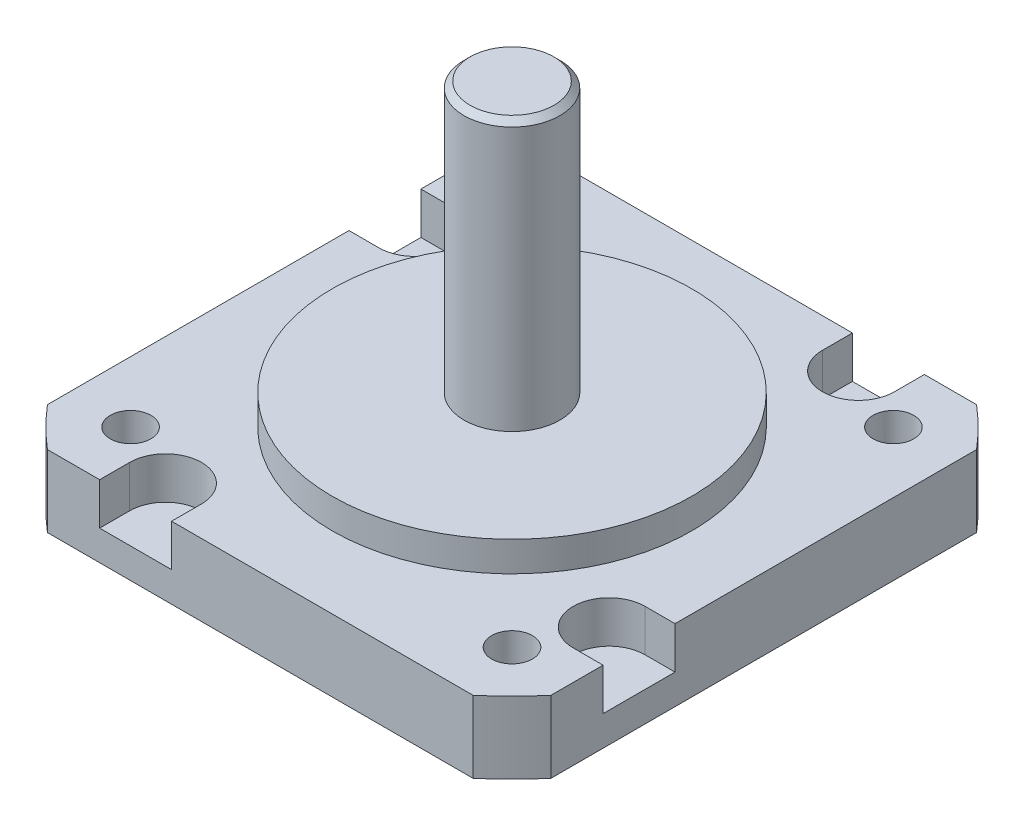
ISO-10303-21;
HEADER;
FILE_DESCRIPTION(('STEP AP214'),'2;1');
FILE_NAME('part.step','',(''),(''),'','','');
FILE_SCHEMA(('AUTOMOTIVE_DESIGN { 1 0 10303 214 1 1 1 1 }'));
ENDSEC;
DATA;
#1=APPLICATION_CONTEXT('core data for automotive mechanical design processes');
#2=APPLICATION_PROTOCOL_DEFINITION('international standard','automotive_design',2000,#1);
#3=PRODUCT_CONTEXT('',#1,'mechanical');
#4=PRODUCT('Part','Part','',(#3));
#5=PRODUCT_RELATED_PRODUCT_CATEGORY('part','',(#4));
#6=PRODUCT_DEFINITION_FORMATION('','',#4);
#7=PRODUCT_DEFINITION_CONTEXT('part definition',#1,'design');
#8=PRODUCT_DEFINITION('design','',#6,#7);
#9=PRODUCT_DEFINITION_SHAPE('','',#8);
#10=(LENGTH_UNIT() NAMED_UNIT(*) SI_UNIT(.MILLI.,.METRE.));
#11=(NAMED_UNIT(*) PLANE_ANGLE_UNIT() SI_UNIT($,.RADIAN.));
#12=(NAMED_UNIT(*) SI_UNIT($,.STERADIAN.) SOLID_ANGLE_UNIT());
#13=UNCERTAINTY_MEASURE_WITH_UNIT(LENGTH_MEASURE(1.E-05),#10,'distance_accuracy_value','');
#14=(GEOMETRIC_REPRESENTATION_CONTEXT(3) GLOBAL_UNCERTAINTY_ASSIGNED_CONTEXT((#13)) GLOBAL_UNIT_ASSIGNED_CONTEXT((#10,
#11,#12)) REPRESENTATION_CONTEXT('',''));
#15=CARTESIAN_POINT('',(0.,0.,0.));
#16=DIRECTION('',(0.,0.,1.));
#17=DIRECTION('',(1.,0.,0.));
#18=AXIS2_PLACEMENT_3D('',#15,#16,#17);
#19=CARTESIAN_POINT('',(0.,13.5,0.));
#20=DIRECTION('',(0.,1.,0.));
#21=DIRECTION('',(0.,0.,1.));
#22=AXIS2_PLACEMENT_3D('',#19,#20,#21);
#23=CYLINDRICAL_SURFACE('',#22,15.);
#24=CARTESIAN_POINT('',(0.,13.5,0.));
#25=DIRECTION('',(0.,1.,0.));
#26=DIRECTION('',(0.,0.,1.));
#27=AXIS2_PLACEMENT_3D('',#24,#25,#26);
#28=CIRCLE('',#27,15.);
#29=CARTESIAN_POINT('',(0.,13.5,15.));
#30=VERTEX_POINT('',#29);
#31=EDGE_CURVE('E11',#30,#30,#28,.T.);
#32=ORIENTED_EDGE('',*,*,#31,.T.);
#33=EDGE_LOOP('',(#32));
#34=FACE_BOUND('',#33,.T.);
#35=CARTESIAN_POINT('',(0.,16.,0.));
#36=DIRECTION('',(0.,1.,0.));
#37=DIRECTION('',(0.,0.,1.));
#38=AXIS2_PLACEMENT_3D('',#35,#36,#37);
#39=CIRCLE('',#38,15.);
#40=CARTESIAN_POINT('',(0.,16.,15.));
#41=VERTEX_POINT('',#40);
#42=EDGE_CURVE('E51',#41,#41,#39,.T.);
#43=ORIENTED_EDGE('',*,*,#42,.F.);
#44=EDGE_LOOP('',(#43));
#45=FACE_BOUND('',#44,.T.);
#46=ADVANCED_FACE('F45',(#34,#45),#23,.T.);
#47=CARTESIAN_POINT('',(15.,13.5,0.));
#48=DIRECTION('',(0.,-1.,0.));
#49=DIRECTION('',(0.,0.,-1.));
#50=AXIS2_PLACEMENT_3D('',#47,#48,#49);
#51=PLANE('',#50);
#52=ORIENTED_EDGE('',*,*,#31,.F.);
#53=EDGE_LOOP('',(#52));
#54=FACE_BOUND('',#53,.T.);
#55=ADVANCED_FACE('F60',(#54),#51,.T.);
#56=CARTESIAN_POINT('',(0.,16.,0.));
#57=DIRECTION('',(0.,1.,0.));
#58=DIRECTION('',(0.,0.,1.));
#59=AXIS2_PLACEMENT_3D('',#56,#57,#58);
#60=PLANE('',#59);
#61=ORIENTED_EDGE('',*,*,#42,.T.);
#62=EDGE_LOOP('',(#61));
#63=FACE_BOUND('',#62,.T.);
#64=ADVANCED_FACE('F57',(#63),#60,.T.);
#65=CLOSED_SHELL('',(#46,#55,#64));
#66=MANIFOLD_SOLID_BREP('B2',#65);
#67=CARTESIAN_POINT('',(0.,7.50000000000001,0.));
#68=DIRECTION('',(0.,1.,0.));
#69=DIRECTION('',(0.,0.,1.));
#70=AXIS2_PLACEMENT_3D('',#67,#68,#69);
#71=CYLINDRICAL_SURFACE('',#70,27.5);
#72=CARTESIAN_POINT('',(0.,13.5,0.));
#73=DIRECTION('',(0.,1.,0.));
#74=DIRECTION('',(0.,0.,1.));
#75=AXIS2_PLACEMENT_3D('',#72,#73,#74);
#76=CIRCLE('',#75,27.5);
#77=CARTESIAN_POINT('',(17.7549999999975,13.5,21.0002374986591));
#78=VERTEX_POINT('',#77);
#79=CARTESIAN_POINT('',(21.000237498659,13.5,17.7549999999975));
#80=VERTEX_POINT('',#79);
#81=EDGE_CURVE('E375',#78,#80,#76,.T.);
#82=ORIENTED_EDGE('',*,*,#81,.F.);
#83=DIRECTION('',(0.,1.,0.));
#84=VECTOR('',#83,1.);
#85=CARTESIAN_POINT('',(17.7549999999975,7.50000000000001,21.0002374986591));
#86=LINE('',#85,#84);
#87=CARTESIAN_POINT('',(17.7549999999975,7.50000000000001,21.0002374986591));
#88=VERTEX_POINT('',#87);
#89=EDGE_CURVE('E43',#88,#78,#86,.T.);
#90=ORIENTED_EDGE('',*,*,#89,.F.);
#91=CARTESIAN_POINT('',(0.,7.50000000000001,0.));
#92=DIRECTION('',(0.,1.,0.));
#93=DIRECTION('',(0.,0.,1.));
#94=AXIS2_PLACEMENT_3D('',#91,#92,#93);
#95=CIRCLE('',#94,27.5);
#96=CARTESIAN_POINT('',(21.000237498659,7.50000000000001,17.7549999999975));
#97=VERTEX_POINT('',#96);
#98=EDGE_CURVE('E383',#88,#97,#95,.T.);
#99=ORIENTED_EDGE('',*,*,#98,.T.);
#100=DIRECTION('',(0.,1.,0.));
#101=VECTOR('',#100,1.);
#102=CARTESIAN_POINT('',(21.000237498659,7.50000000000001,17.7549999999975));
#103=LINE('',#102,#101);
#104=EDGE_CURVE('E408',#97,#80,#103,.T.);
#105=ORIENTED_EDGE('',*,*,#104,.T.);
#106=EDGE_LOOP('',(#82,#90,#99,#105));
#107=FACE_BOUND('',#106,.T.);
#108=ADVANCED_FACE('F94',(#107),#71,.T.);
#109=CARTESIAN_POINT('',(-17.7549999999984,7.50000000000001,21.0002374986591));
#110=DIRECTION('',(0.,0.,1.));
#111=DIRECTION('',(1.,0.,0.));
#112=AXIS2_PLACEMENT_3D('',#109,#110,#111);
#113=PLANE('',#112);
#114=DIRECTION('',(0.,1.,0.));
#115=VECTOR('',#114,1.);
#116=CARTESIAN_POINT('',(-7.40000000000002,10.,21.00023749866));
#117=LINE('',#116,#115);
#118=CARTESIAN_POINT('',(-7.40000000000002,10.,21.00023749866));
#119=VERTEX_POINT('',#118);
#120=CARTESIAN_POINT('',(-7.40000000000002,13.5,21.00023749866));
#121=VERTEX_POINT('',#120);
#122=EDGE_CURVE('E376',#119,#121,#117,.T.);
#123=ORIENTED_EDGE('',*,*,#122,.F.);
#124=DIRECTION('',(1.,0.,0.));
#125=VECTOR('',#124,1.);
#126=CARTESIAN_POINT('',(-13.4,10.,21.00023749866));
#127=LINE('',#126,#125);
#128=CARTESIAN_POINT('',(-13.4,10.,21.00023749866));
#129=VERTEX_POINT('',#128);
#130=EDGE_CURVE('E362',#129,#119,#127,.T.);
#131=ORIENTED_EDGE('',*,*,#130,.F.);
#132=DIRECTION('',(0.,1.,0.));
#133=VECTOR('',#132,1.);
#134=CARTESIAN_POINT('',(-13.4,10.,21.00023749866));
#135=LINE('',#134,#133);
#136=CARTESIAN_POINT('',(-13.4,13.5,21.00023749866));
#137=VERTEX_POINT('',#136);
#138=EDGE_CURVE('E378',#129,#137,#135,.T.);
#139=ORIENTED_EDGE('',*,*,#138,.T.);
#140=DIRECTION('',(1.,0.,0.));
#141=VECTOR('',#140,1.);
#142=CARTESIAN_POINT('',(-17.7549999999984,13.5,21.0002374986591));
#143=LINE('',#142,#141);
#144=CARTESIAN_POINT('',(-17.7549999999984,13.5,21.0002374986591));
#145=VERTEX_POINT('',#144);
#146=EDGE_CURVE('E387',#145,#137,#143,.T.);
#147=ORIENTED_EDGE('',*,*,#146,.F.);
#148=DIRECTION('',(0.,1.,0.));
#149=VECTOR('',#148,1.);
#150=CARTESIAN_POINT('',(-17.7549999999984,7.50000000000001,21.0002374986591));
#151=LINE('',#150,#149);
#152=CARTESIAN_POINT('',(-17.7549999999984,7.50000000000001,21.0002374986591));
#153=VERTEX_POINT('',#152);
#154=EDGE_CURVE('E102',#153,#145,#151,.T.);
#155=ORIENTED_EDGE('',*,*,#154,.F.);
#156=DIRECTION('',(1.,0.,0.));
#157=VECTOR('',#156,1.);
#158=CARTESIAN_POINT('',(-17.7549999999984,7.50000000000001,21.0002374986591));
#159=LINE('',#158,#157);
#160=EDGE_CURVE('E405',#153,#88,#159,.T.);
#161=ORIENTED_EDGE('',*,*,#160,.T.);
#162=ORIENTED_EDGE('',*,*,#89,.T.);
#163=EDGE_CURVE('E432',#121,#78,#143,.T.);
#164=ORIENTED_EDGE('',*,*,#163,.F.);
#165=EDGE_LOOP('',(#123,#131,#139,#147,#155,#161,#162,#164));
#166=FACE_BOUND('',#165,.T.);
#167=ADVANCED_FACE('F492',(#166),#113,.T.);
#168=CARTESIAN_POINT('',(0.,7.50000000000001,0.));
#169=DIRECTION('',(0.,1.,0.));
#170=DIRECTION('',(0.,0.,1.));
#171=AXIS2_PLACEMENT_3D('',#168,#169,#170);
#172=CYLINDRICAL_SURFACE('',#171,27.5000000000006);
#173=CARTESIAN_POINT('',(0.,13.5,0.));
#174=DIRECTION('',(0.,1.,0.));
#175=DIRECTION('',(0.,0.,1.));
#176=AXIS2_PLACEMENT_3D('',#173,#174,#175);
#177=CIRCLE('',#176,27.5000000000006);
#178=CARTESIAN_POINT('',(-21.00023749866,13.5,17.7549999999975));
#179=VERTEX_POINT('',#178);
#180=EDGE_CURVE('E429',#179,#145,#177,.T.);
#181=ORIENTED_EDGE('',*,*,#180,.F.);
#182=DIRECTION('',(0.,1.,0.));
#183=VECTOR('',#182,1.);
#184=CARTESIAN_POINT('',(-21.00023749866,7.50000000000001,17.7549999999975));
#185=LINE('',#184,#183);
#186=CARTESIAN_POINT('',(-21.00023749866,7.50000000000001,17.7549999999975));
#187=VERTEX_POINT('',#186);
#188=EDGE_CURVE('E436',#187,#179,#185,.T.);
#189=ORIENTED_EDGE('',*,*,#188,.F.);
#190=CARTESIAN_POINT('',(0.,7.50000000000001,0.));
#191=DIRECTION('',(0.,1.,0.));
#192=DIRECTION('',(0.,0.,1.));
#193=AXIS2_PLACEMENT_3D('',#190,#191,#192);
#194=CIRCLE('',#193,27.5000000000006);
#195=EDGE_CURVE('E402',#187,#153,#194,.T.);
#196=ORIENTED_EDGE('',*,*,#195,.T.);
#197=ORIENTED_EDGE('',*,*,#154,.T.);
#198=EDGE_LOOP('',(#181,#189,#196,#197));
#199=FACE_BOUND('',#198,.T.);
#200=ADVANCED_FACE('F498',(#199),#172,.T.);
#201=CARTESIAN_POINT('',(-21.00023749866,7.50000000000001,-17.7549999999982));
#202=DIRECTION('',(-1.,0.,0.));
#203=DIRECTION('',(0.,0.,1.));
#204=AXIS2_PLACEMENT_3D('',#201,#202,#203);
#205=PLANE('',#204);
#206=DIRECTION('',(0.,1.,0.));
#207=VECTOR('',#206,1.);
#208=CARTESIAN_POINT('',(-21.00023749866,10.,-7.39999999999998));
#209=LINE('',#208,#207);
#210=CARTESIAN_POINT('',(-21.00023749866,10.,-7.39999999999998));
#211=VERTEX_POINT('',#210);
#212=CARTESIAN_POINT('',(-21.00023749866,13.5,-7.39999999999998));
#213=VERTEX_POINT('',#212);
#214=EDGE_CURVE('E294',#211,#213,#209,.T.);
#215=ORIENTED_EDGE('',*,*,#214,.F.);
#216=DIRECTION('',(0.,0.,1.));
#217=VECTOR('',#216,1.);
#218=CARTESIAN_POINT('',(-21.00023749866,10.,-13.4));
#219=LINE('',#218,#217);
#220=CARTESIAN_POINT('',(-21.00023749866,10.,-13.4));
#221=VERTEX_POINT('',#220);
#222=EDGE_CURVE('E283',#221,#211,#219,.T.);
#223=ORIENTED_EDGE('',*,*,#222,.F.);
#224=DIRECTION('',(0.,1.,0.));
#225=VECTOR('',#224,1.);
#226=CARTESIAN_POINT('',(-21.00023749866,10.,-13.4));
#227=LINE('',#226,#225);
#228=CARTESIAN_POINT('',(-21.00023749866,13.5,-13.4));
#229=VERTEX_POINT('',#228);
#230=EDGE_CURVE('E296',#221,#229,#227,.T.);
#231=ORIENTED_EDGE('',*,*,#230,.T.);
#232=DIRECTION('',(0.,0.,1.));
#233=VECTOR('',#232,1.);
#234=CARTESIAN_POINT('',(-21.00023749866,13.5,-17.7549999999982));
#235=LINE('',#234,#233);
#236=CARTESIAN_POINT('',(-21.00023749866,13.5,-17.7549999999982));
#237=VERTEX_POINT('',#236);
#238=EDGE_CURVE('E426',#237,#229,#235,.T.);
#239=ORIENTED_EDGE('',*,*,#238,.F.);
#240=DIRECTION('',(0.,1.,0.));
#241=VECTOR('',#240,1.);
#242=CARTESIAN_POINT('',(-21.00023749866,7.50000000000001,-17.7549999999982));
#243=LINE('',#242,#241);
#244=CARTESIAN_POINT('',(-21.00023749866,7.50000000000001,-17.7549999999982));
#245=VERTEX_POINT('',#244);
#246=EDGE_CURVE('E439',#245,#237,#243,.T.);
#247=ORIENTED_EDGE('',*,*,#246,.F.);
#248=DIRECTION('',(0.,0.,1.));
#249=VECTOR('',#248,1.);
#250=CARTESIAN_POINT('',(-21.00023749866,7.50000000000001,-17.7549999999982));
#251=LINE('',#250,#249);
#252=EDGE_CURVE('E399',#245,#187,#251,.T.);
#253=ORIENTED_EDGE('',*,*,#252,.T.);
#254=ORIENTED_EDGE('',*,*,#188,.T.);
#255=EDGE_CURVE('E425',#213,#179,#235,.T.);
#256=ORIENTED_EDGE('',*,*,#255,.F.);
#257=EDGE_LOOP('',(#215,#223,#231,#239,#247,#253,#254,#256));
#258=FACE_BOUND('',#257,.T.);
#259=ADVANCED_FACE('F503',(#258),#205,.T.);
#260=CARTESIAN_POINT('',(0.,7.50000000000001,0.));
#261=DIRECTION('',(0.,1.,0.));
#262=DIRECTION('',(0.,0.,1.));
#263=AXIS2_PLACEMENT_3D('',#260,#261,#262);
#264=CYLINDRICAL_SURFACE('',#263,27.5000000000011);
#265=CARTESIAN_POINT('',(0.,13.5,0.));
#266=DIRECTION('',(0.,1.,0.));
#267=DIRECTION('',(0.,0.,1.));
#268=AXIS2_PLACEMENT_3D('',#265,#266,#267);
#269=CIRCLE('',#268,27.5000000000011);
#270=CARTESIAN_POINT('',(-17.7549999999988,13.5,-21.0002374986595));
#271=VERTEX_POINT('',#270);
#272=EDGE_CURVE('E422',#271,#237,#269,.T.);
#273=ORIENTED_EDGE('',*,*,#272,.F.);
#274=DIRECTION('',(0.,1.,0.));
#275=VECTOR('',#274,1.);
#276=CARTESIAN_POINT('',(-17.7549999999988,7.50000000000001,-21.0002374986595));
#277=LINE('',#276,#275);
#278=CARTESIAN_POINT('',(-17.7549999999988,7.50000000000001,-21.0002374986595));
#279=VERTEX_POINT('',#278);
#280=EDGE_CURVE('E441',#279,#271,#277,.T.);
#281=ORIENTED_EDGE('',*,*,#280,.F.);
#282=CARTESIAN_POINT('',(0.,7.50000000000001,0.));
#283=DIRECTION('',(0.,1.,0.));
#284=DIRECTION('',(0.,0.,1.));
#285=AXIS2_PLACEMENT_3D('',#282,#283,#284);
#286=CIRCLE('',#285,27.5000000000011);
#287=EDGE_CURVE('E396',#279,#245,#286,.T.);
#288=ORIENTED_EDGE('',*,*,#287,.T.);
#289=ORIENTED_EDGE('',*,*,#246,.T.);
#290=EDGE_LOOP('',(#273,#281,#288,#289));
#291=FACE_BOUND('',#290,.T.);
#292=ADVANCED_FACE('F508',(#291),#264,.T.);
#293=CARTESIAN_POINT('',(17.7549999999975,7.50000000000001,-21.0002374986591));
#294=DIRECTION('',(0.,0.,-1.));
#295=DIRECTION('',(-1.,0.,0.));
#296=AXIS2_PLACEMENT_3D('',#293,#294,#295);
#297=PLANE('',#296);
#298=DIRECTION('',(0.,1.,0.));
#299=VECTOR('',#298,1.);
#300=CARTESIAN_POINT('',(7.39999999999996,10.,-21.00023749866));
#301=LINE('',#300,#299);
#302=CARTESIAN_POINT('',(7.39999999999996,10.,-21.00023749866));
#303=VERTEX_POINT('',#302);
#304=CARTESIAN_POINT('',(7.39999999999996,13.5,-21.00023749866));
#305=VERTEX_POINT('',#304);
#306=EDGE_CURVE('E321',#303,#305,#301,.T.);
#307=ORIENTED_EDGE('',*,*,#306,.F.);
#308=DIRECTION('',(-1.,0.,0.));
#309=VECTOR('',#308,1.);
#310=CARTESIAN_POINT('',(13.4,10.,-21.00023749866));
#311=LINE('',#310,#309);
#312=CARTESIAN_POINT('',(13.4,10.,-21.00023749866));
#313=VERTEX_POINT('',#312);
#314=EDGE_CURVE('E307',#313,#303,#311,.T.);
#315=ORIENTED_EDGE('',*,*,#314,.F.);
#316=DIRECTION('',(0.,1.,0.));
#317=VECTOR('',#316,1.);
#318=CARTESIAN_POINT('',(13.4,10.,-21.00023749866));
#319=LINE('',#318,#317);
#320=CARTESIAN_POINT('',(13.4,13.5,-21.00023749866));
#321=VERTEX_POINT('',#320);
#322=EDGE_CURVE('E323',#313,#321,#319,.T.);
#323=ORIENTED_EDGE('',*,*,#322,.T.);
#324=DIRECTION('',(-1.,0.,0.));
#325=VECTOR('',#324,1.);
#326=CARTESIAN_POINT('',(17.7549999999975,13.5,-21.0002374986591));
#327=LINE('',#326,#325);
#328=CARTESIAN_POINT('',(17.7549999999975,13.5,-21.0002374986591));
#329=VERTEX_POINT('',#328);
#330=EDGE_CURVE('E419',#329,#321,#327,.T.);
#331=ORIENTED_EDGE('',*,*,#330,.F.);
#332=DIRECTION('',(0.,1.,0.));
#333=VECTOR('',#332,1.);
#334=CARTESIAN_POINT('',(17.7549999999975,7.50000000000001,-21.0002374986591));
#335=LINE('',#334,#333);
#336=CARTESIAN_POINT('',(17.7549999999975,7.50000000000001,-21.0002374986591));
#337=VERTEX_POINT('',#336);
#338=EDGE_CURVE('E444',#337,#329,#335,.T.);
#339=ORIENTED_EDGE('',*,*,#338,.F.);
#340=DIRECTION('',(-1.,0.,0.));
#341=VECTOR('',#340,1.);
#342=CARTESIAN_POINT('',(17.7549999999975,7.50000000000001,-21.0002374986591));
#343=LINE('',#342,#341);
#344=EDGE_CURVE('E393',#337,#279,#343,.T.);
#345=ORIENTED_EDGE('',*,*,#344,.T.);
#346=ORIENTED_EDGE('',*,*,#280,.T.);
#347=EDGE_CURVE('E418',#305,#271,#327,.T.);
#348=ORIENTED_EDGE('',*,*,#347,.F.);
#349=EDGE_LOOP('',(#307,#315,#323,#331,#339,#345,#346,#348));
#350=FACE_BOUND('',#349,.T.);
#351=ADVANCED_FACE('F512',(#350),#297,.T.);
#352=CARTESIAN_POINT('',(0.,7.50000000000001,0.));
#353=DIRECTION('',(0.,1.,0.));
#354=DIRECTION('',(0.,0.,1.));
#355=AXIS2_PLACEMENT_3D('',#352,#353,#354);
#356=CYLINDRICAL_SURFACE('',#355,27.5000000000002);
#357=CARTESIAN_POINT('',(0.,13.5,0.));
#358=DIRECTION('',(0.,1.,0.));
#359=DIRECTION('',(0.,0.,1.));
#360=AXIS2_PLACEMENT_3D('',#357,#358,#359);
#361=CIRCLE('',#360,27.5000000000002);
#362=CARTESIAN_POINT('',(21.0002374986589,13.5,-17.7549999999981));
#363=VERTEX_POINT('',#362);
#364=EDGE_CURVE('E415',#363,#329,#361,.T.);
#365=ORIENTED_EDGE('',*,*,#364,.F.);
#366=DIRECTION('',(0.,1.,0.));
#367=VECTOR('',#366,1.);
#368=CARTESIAN_POINT('',(21.0002374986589,7.50000000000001,-17.7549999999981));
#369=LINE('',#368,#367);
#370=CARTESIAN_POINT('',(21.0002374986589,7.50000000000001,-17.7549999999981));
#371=VERTEX_POINT('',#370);
#372=EDGE_CURVE('E446',#371,#363,#369,.T.);
#373=ORIENTED_EDGE('',*,*,#372,.F.);
#374=CARTESIAN_POINT('',(0.,7.50000000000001,0.));
#375=DIRECTION('',(0.,1.,0.));
#376=DIRECTION('',(0.,0.,1.));
#377=AXIS2_PLACEMENT_3D('',#374,#375,#376);
#378=CIRCLE('',#377,27.5000000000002);
#379=EDGE_CURVE('E390',#371,#337,#378,.T.);
#380=ORIENTED_EDGE('',*,*,#379,.T.);
#381=ORIENTED_EDGE('',*,*,#338,.T.);
#382=EDGE_LOOP('',(#365,#373,#380,#381));
#383=FACE_BOUND('',#382,.T.);
#384=ADVANCED_FACE('F517',(#383),#356,.T.);
#385=CARTESIAN_POINT('',(21.000237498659,7.50000000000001,17.7549999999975));
#386=DIRECTION('',(1.,0.,0.));
#387=DIRECTION('',(0.,0.,-1.));
#388=AXIS2_PLACEMENT_3D('',#385,#386,#387);
#389=PLANE('',#388);
#390=DIRECTION('',(0.,1.,0.));
#391=VECTOR('',#390,1.);
#392=CARTESIAN_POINT('',(21.00023749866,10.,7.4));
#393=LINE('',#392,#391);
#394=CARTESIAN_POINT('',(21.00023749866,10.,7.4));
#395=VERTEX_POINT('',#394);
#396=CARTESIAN_POINT('',(21.00023749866,13.5,7.4));
#397=VERTEX_POINT('',#396);
#398=EDGE_CURVE('E348',#395,#397,#393,.T.);
#399=ORIENTED_EDGE('',*,*,#398,.F.);
#400=DIRECTION('',(0.,0.,-1.));
#401=VECTOR('',#400,1.);
#402=CARTESIAN_POINT('',(21.00023749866,10.,13.4));
#403=LINE('',#402,#401);
#404=CARTESIAN_POINT('',(21.00023749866,10.,13.4));
#405=VERTEX_POINT('',#404);
#406=EDGE_CURVE('E334',#405,#395,#403,.T.);
#407=ORIENTED_EDGE('',*,*,#406,.F.);
#408=DIRECTION('',(0.,1.,0.));
#409=VECTOR('',#408,1.);
#410=CARTESIAN_POINT('',(21.00023749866,10.,13.4));
#411=LINE('',#410,#409);
#412=CARTESIAN_POINT('',(21.00023749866,13.5,13.4));
#413=VERTEX_POINT('',#412);
#414=EDGE_CURVE('E350',#405,#413,#411,.T.);
#415=ORIENTED_EDGE('',*,*,#414,.T.);
#416=DIRECTION('',(0.,0.,-1.));
#417=VECTOR('',#416,1.);
#418=CARTESIAN_POINT('',(21.000237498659,13.5,17.7549999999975));
#419=LINE('',#418,#417);
#420=EDGE_CURVE('E412',#80,#413,#419,.T.);
#421=ORIENTED_EDGE('',*,*,#420,.F.);
#422=ORIENTED_EDGE('',*,*,#104,.F.);
#423=DIRECTION('',(0.,0.,-1.));
#424=VECTOR('',#423,1.);
#425=CARTESIAN_POINT('',(21.000237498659,7.50000000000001,17.7549999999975));
#426=LINE('',#425,#424);
#427=EDGE_CURVE('E386',#97,#371,#426,.T.);
#428=ORIENTED_EDGE('',*,*,#427,.T.);
#429=ORIENTED_EDGE('',*,*,#372,.T.);
#430=EDGE_CURVE('E411',#397,#363,#419,.T.);
#431=ORIENTED_EDGE('',*,*,#430,.F.);
#432=EDGE_LOOP('',(#399,#407,#415,#421,#422,#428,#429,#431));
#433=FACE_BOUND('',#432,.T.);
#434=ADVANCED_FACE('F479',(#433),#389,.T.);
#435=CARTESIAN_POINT('',(0.,7.50000000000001,0.));
#436=DIRECTION('',(0.,1.,0.));
#437=DIRECTION('',(0.,0.,1.));
#438=AXIS2_PLACEMENT_3D('',#435,#436,#437);
#439=PLANE('',#438);
#440=CARTESIAN_POINT('',(15.9099025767,7.50000000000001,-15.9099025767));
#441=DIRECTION('',(0.,-1.,0.));
#442=DIRECTION('',(0.,0.,-1.));
#443=AXIS2_PLACEMENT_3D('',#440,#441,#442);
#444=CIRCLE('',#443,1.69999999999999);
#445=CARTESIAN_POINT('',(15.9099025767,7.50000000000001,-17.6099025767));
#446=VERTEX_POINT('',#445);
#447=EDGE_CURVE('E468',#446,#446,#444,.T.);
#448=ORIENTED_EDGE('',*,*,#447,.F.);
#449=EDGE_LOOP('',(#448));
#450=FACE_BOUND('',#449,.T.);
#451=CARTESIAN_POINT('',(-15.9099025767,7.50000000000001,-15.9099025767));
#452=DIRECTION('',(0.,-1.,0.));
#453=DIRECTION('',(0.,0.,-1.));
#454=AXIS2_PLACEMENT_3D('',#451,#452,#453);
#455=CIRCLE('',#454,1.69999999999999);
#456=CARTESIAN_POINT('',(-15.9099025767,7.50000000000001,-17.6099025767));
#457=VERTEX_POINT('',#456);
#458=EDGE_CURVE('E458',#457,#457,#455,.T.);
#459=ORIENTED_EDGE('',*,*,#458,.F.);
#460=EDGE_LOOP('',(#459));
#461=FACE_BOUND('',#460,.T.);
#462=CARTESIAN_POINT('',(-15.9099025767,7.50000000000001,15.9099025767));
#463=DIRECTION('',(0.,-1.,0.));
#464=DIRECTION('',(0.,0.,-1.));
#465=AXIS2_PLACEMENT_3D('',#462,#463,#464);
#466=CIRCLE('',#465,1.69999999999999);
#467=CARTESIAN_POINT('',(-15.9099025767,7.50000000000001,14.2099025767));
#468=VERTEX_POINT('',#467);
#469=EDGE_CURVE('E455',#468,#468,#466,.T.);
#470=ORIENTED_EDGE('',*,*,#469,.F.);
#471=EDGE_LOOP('',(#470));
#472=FACE_BOUND('',#471,.T.);
#473=CARTESIAN_POINT('',(15.9099025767,7.50000000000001,15.9099025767));
#474=DIRECTION('',(0.,-1.,0.));
#475=DIRECTION('',(0.,0.,-1.));
#476=AXIS2_PLACEMENT_3D('',#473,#474,#475);
#477=CIRCLE('',#476,1.69999999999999);
#478=CARTESIAN_POINT('',(15.9099025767,7.50000000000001,14.2099025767));
#479=VERTEX_POINT('',#478);
#480=EDGE_CURVE('E452',#479,#479,#477,.T.);
#481=ORIENTED_EDGE('',*,*,#480,.F.);
#482=EDGE_LOOP('',(#481));
#483=FACE_BOUND('',#482,.T.);
#484=CARTESIAN_POINT('',(0.,7.50000000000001,0.));
#485=DIRECTION('',(0.,-1.,0.));
#486=DIRECTION('',(0.,0.,-1.));
#487=AXIS2_PLACEMENT_3D('',#484,#485,#486);
#488=CIRCLE('',#487,0.25);
#489=CARTESIAN_POINT('',(0.,7.50000000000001,-0.25));
#490=VERTEX_POINT('',#489);
#491=EDGE_CURVE('E267',#490,#490,#488,.T.);
#492=ORIENTED_EDGE('',*,*,#491,.F.);
#493=EDGE_LOOP('',(#492));
#494=FACE_BOUND('',#493,.T.);
#495=ORIENTED_EDGE('',*,*,#98,.F.);
#496=ORIENTED_EDGE('',*,*,#160,.F.);
#497=ORIENTED_EDGE('',*,*,#195,.F.);
#498=ORIENTED_EDGE('',*,*,#252,.F.);
#499=ORIENTED_EDGE('',*,*,#287,.F.);
#500=ORIENTED_EDGE('',*,*,#344,.F.);
#501=ORIENTED_EDGE('',*,*,#379,.F.);
#502=ORIENTED_EDGE('',*,*,#427,.F.);
#503=EDGE_LOOP('',(#495,#496,#497,#498,#499,#500,#501,#502));
#504=FACE_BOUND('',#503,.T.);
#505=ADVANCED_FACE('F475',(#450,#461,#472,#483,#494,#504),#439,.F.);
#506=CARTESIAN_POINT('',(0.,13.5,0.));
#507=DIRECTION('',(0.,1.,0.));
#508=DIRECTION('',(0.,0.,1.));
#509=AXIS2_PLACEMENT_3D('',#506,#507,#508);
#510=PLANE('',#509);
#511=CARTESIAN_POINT('',(15.9099025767,13.5,-15.9099025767));
#512=DIRECTION('',(0.,1.,0.));
#513=DIRECTION('',(0.,0.,1.));
#514=AXIS2_PLACEMENT_3D('',#511,#512,#513);
#515=CIRCLE('',#514,1.69999999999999);
#516=CARTESIAN_POINT('',(15.9099025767,13.5,-14.2099025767));
#517=VERTEX_POINT('',#516);
#518=EDGE_CURVE('E97',#517,#517,#515,.T.);
#519=ORIENTED_EDGE('',*,*,#518,.F.);
#520=EDGE_LOOP('',(#519));
#521=FACE_BOUND('',#520,.T.);
#522=CARTESIAN_POINT('',(-15.9099025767,13.5,-15.9099025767));
#523=DIRECTION('',(0.,1.,0.));
#524=DIRECTION('',(0.,0.,1.));
#525=AXIS2_PLACEMENT_3D('',#522,#523,#524);
#526=CIRCLE('',#525,1.69999999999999);
#527=CARTESIAN_POINT('',(-15.9099025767,13.5,-14.2099025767));
#528=VERTEX_POINT('',#527);
#529=EDGE_CURVE('E456',#528,#528,#526,.T.);
#530=ORIENTED_EDGE('',*,*,#529,.F.);
#531=EDGE_LOOP('',(#530));
#532=FACE_BOUND('',#531,.T.);
#533=CARTESIAN_POINT('',(-15.9099025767,13.5,15.9099025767));
#534=DIRECTION('',(0.,1.,0.));
#535=DIRECTION('',(0.,0.,1.));
#536=AXIS2_PLACEMENT_3D('',#533,#534,#535);
#537=CIRCLE('',#536,1.69999999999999);
#538=CARTESIAN_POINT('',(-15.9099025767,13.5,17.6099025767));
#539=VERTEX_POINT('',#538);
#540=EDGE_CURVE('E453',#539,#539,#537,.T.);
#541=ORIENTED_EDGE('',*,*,#540,.F.);
#542=EDGE_LOOP('',(#541));
#543=FACE_BOUND('',#542,.T.);
#544=CARTESIAN_POINT('',(15.9099025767,13.5,15.9099025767));
#545=DIRECTION('',(0.,1.,0.));
#546=DIRECTION('',(0.,0.,1.));
#547=AXIS2_PLACEMENT_3D('',#544,#545,#546);
#548=CIRCLE('',#547,1.69999999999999);
#549=CARTESIAN_POINT('',(15.9099025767,13.5,17.6099025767));
#550=VERTEX_POINT('',#549);
#551=EDGE_CURVE('E272',#550,#550,#548,.T.);
#552=ORIENTED_EDGE('',*,*,#551,.F.);
#553=EDGE_LOOP('',(#552));
#554=FACE_BOUND('',#553,.T.);
#555=DIRECTION('',(1.,0.,0.));
#556=VECTOR('',#555,1.);
#557=CARTESIAN_POINT('',(-21.00023749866,13.5,-7.39999999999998));
#558=LINE('',#557,#556);
#559=CARTESIAN_POINT('',(-18.50023749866,13.5,-7.39999999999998));
#560=VERTEX_POINT('',#559);
#561=EDGE_CURVE('E280',#213,#560,#558,.T.);
#562=ORIENTED_EDGE('',*,*,#561,.F.);
#563=ORIENTED_EDGE('',*,*,#255,.T.);
#564=ORIENTED_EDGE('',*,*,#180,.T.);
#565=ORIENTED_EDGE('',*,*,#146,.T.);
#566=DIRECTION('',(0.,0.,1.));
#567=VECTOR('',#566,1.);
#568=CARTESIAN_POINT('',(-13.4,13.5,18.50023749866));
#569=LINE('',#568,#567);
#570=CARTESIAN_POINT('',(-13.4,13.5,18.50023749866));
#571=VERTEX_POINT('',#570);
#572=EDGE_CURVE('E369',#571,#137,#569,.T.);
#573=ORIENTED_EDGE('',*,*,#572,.F.);
#574=CARTESIAN_POINT('',(-10.4,13.5,18.50023749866));
#575=DIRECTION('',(0.,1.,0.));
#576=DIRECTION('',(0.,0.,1.));
#577=AXIS2_PLACEMENT_3D('',#574,#575,#576);
#578=CIRCLE('',#577,3.);
#579=CARTESIAN_POINT('',(-7.40000000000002,13.5,18.50023749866));
#580=VERTEX_POINT('',#579);
#581=EDGE_CURVE('E347',#580,#571,#578,.T.);
#582=ORIENTED_EDGE('',*,*,#581,.F.);
#583=DIRECTION('',(0.,0.,-1.));
#584=VECTOR('',#583,1.);
#585=CARTESIAN_POINT('',(-7.40000000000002,13.5,21.00023749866));
#586=LINE('',#585,#584);
#587=EDGE_CURVE('E359',#121,#580,#586,.T.);
#588=ORIENTED_EDGE('',*,*,#587,.F.);
#589=ORIENTED_EDGE('',*,*,#163,.T.);
#590=ORIENTED_EDGE('',*,*,#81,.T.);
#591=ORIENTED_EDGE('',*,*,#420,.T.);
#592=DIRECTION('',(1.,0.,0.));
#593=VECTOR('',#592,1.);
#594=CARTESIAN_POINT('',(18.50023749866,13.5,13.4));
#595=LINE('',#594,#593);
#596=CARTESIAN_POINT('',(18.50023749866,13.5,13.4));
#597=VERTEX_POINT('',#596);
#598=EDGE_CURVE('E341',#597,#413,#595,.T.);
#599=ORIENTED_EDGE('',*,*,#598,.F.);
#600=CARTESIAN_POINT('',(18.50023749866,13.5,10.4));
#601=DIRECTION('',(0.,1.,0.));
#602=DIRECTION('',(0.,0.,1.));
#603=AXIS2_PLACEMENT_3D('',#600,#601,#602);
#604=CIRCLE('',#603,3.);
#605=CARTESIAN_POINT('',(18.50023749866,13.5,7.4));
#606=VERTEX_POINT('',#605);
#607=EDGE_CURVE('E320',#606,#597,#604,.T.);
#608=ORIENTED_EDGE('',*,*,#607,.F.);
#609=DIRECTION('',(-1.,0.,0.));
#610=VECTOR('',#609,1.);
#611=CARTESIAN_POINT('',(21.00023749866,13.5,7.4));
#612=LINE('',#611,#610);
#613=EDGE_CURVE('E331',#397,#606,#612,.T.);
#614=ORIENTED_EDGE('',*,*,#613,.F.);
#615=ORIENTED_EDGE('',*,*,#430,.T.);
#616=ORIENTED_EDGE('',*,*,#364,.T.);
#617=ORIENTED_EDGE('',*,*,#330,.T.);
#618=DIRECTION('',(0.,0.,-1.));
#619=VECTOR('',#618,1.);
#620=CARTESIAN_POINT('',(13.4,13.5,-18.50023749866));
#621=LINE('',#620,#619);
#622=CARTESIAN_POINT('',(13.4,13.5,-18.50023749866));
#623=VERTEX_POINT('',#622);
#624=EDGE_CURVE('E314',#623,#321,#621,.T.);
#625=ORIENTED_EDGE('',*,*,#624,.F.);
#626=CARTESIAN_POINT('',(10.4,13.5,-18.50023749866));
#627=DIRECTION('',(0.,1.,0.));
#628=DIRECTION('',(0.,0.,1.));
#629=AXIS2_PLACEMENT_3D('',#626,#627,#628);
#630=CIRCLE('',#629,3.);
#631=CARTESIAN_POINT('',(7.4,13.5,-18.50023749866));
#632=VERTEX_POINT('',#631);
#633=EDGE_CURVE('E118',#632,#623,#630,.T.);
#634=ORIENTED_EDGE('',*,*,#633,.F.);
#635=DIRECTION('',(0.,0.,1.));
#636=VECTOR('',#635,1.);
#637=CARTESIAN_POINT('',(7.39999999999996,13.5,-21.00023749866));
#638=LINE('',#637,#636);
#639=EDGE_CURVE('E304',#305,#632,#638,.T.);
#640=ORIENTED_EDGE('',*,*,#639,.F.);
#641=ORIENTED_EDGE('',*,*,#347,.T.);
#642=ORIENTED_EDGE('',*,*,#272,.T.);
#643=ORIENTED_EDGE('',*,*,#238,.T.);
#644=DIRECTION('',(-1.,0.,0.));
#645=VECTOR('',#644,1.);
#646=CARTESIAN_POINT('',(-18.50023749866,13.5,-13.4));
#647=LINE('',#646,#645);
#648=CARTESIAN_POINT('',(-18.50023749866,13.5,-13.4));
#649=VERTEX_POINT('',#648);
#650=EDGE_CURVE('E269',#649,#229,#647,.T.);
#651=ORIENTED_EDGE('',*,*,#650,.F.);
#652=CARTESIAN_POINT('',(-18.50023749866,13.5,-10.4));
#653=DIRECTION('',(0.,1.,0.));
#654=DIRECTION('',(0.,0.,1.));
#655=AXIS2_PLACEMENT_3D('',#652,#653,#654);
#656=CIRCLE('',#655,3.);
#657=EDGE_CURVE('E110',#560,#649,#656,.T.);
#658=ORIENTED_EDGE('',*,*,#657,.F.);
#659=EDGE_LOOP('',(#562,#563,#564,#565,#573,#582,#588,#589,#590,#591,#599,#608,#614,#615,#616,
#617,#625,#634,#640,#641,#642,#643,#651,#658));
#660=FACE_BOUND('',#659,.T.);
#661=ADVANCED_FACE('F478',(#521,#532,#543,#554,#660),#510,.T.);
#662=CARTESIAN_POINT('',(-10.4,10.,18.50023749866));
#663=DIRECTION('',(0.,1.,0.));
#664=DIRECTION('',(0.,0.,1.));
#665=AXIS2_PLACEMENT_3D('',#662,#663,#664);
#666=CYLINDRICAL_SURFACE('',#665,3.);
#667=ORIENTED_EDGE('',*,*,#581,.T.);
#668=DIRECTION('',(0.,1.,0.));
#669=VECTOR('',#668,1.);
#670=CARTESIAN_POINT('',(-13.4,10.,18.50023749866));
#671=LINE('',#670,#669);
#672=CARTESIAN_POINT('',(-13.4,10.,18.50023749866));
#673=VERTEX_POINT('',#672);
#674=EDGE_CURVE('E367',#673,#571,#671,.T.);
#675=ORIENTED_EDGE('',*,*,#674,.F.);
#676=CARTESIAN_POINT('',(-10.4,10.,18.50023749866));
#677=DIRECTION('',(0.,1.,0.));
#678=DIRECTION('',(0.,0.,1.));
#679=AXIS2_PLACEMENT_3D('',#676,#677,#678);
#680=CIRCLE('',#679,3.);
#681=CARTESIAN_POINT('',(-7.40000000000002,10.,18.50023749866));
#682=VERTEX_POINT('',#681);
#683=EDGE_CURVE('E355',#682,#673,#680,.T.);
#684=ORIENTED_EDGE('',*,*,#683,.F.);
#685=DIRECTION('',(0.,1.,0.));
#686=VECTOR('',#685,1.);
#687=CARTESIAN_POINT('',(-7.40000000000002,10.,18.50023749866));
#688=LINE('',#687,#686);
#689=EDGE_CURVE('E373',#682,#580,#688,.T.);
#690=ORIENTED_EDGE('',*,*,#689,.T.);
#691=EDGE_LOOP('',(#667,#675,#684,#690));
#692=FACE_BOUND('',#691,.T.);
#693=ADVANCED_FACE('F616',(#692),#666,.F.);
#694=CARTESIAN_POINT('',(-7.40000000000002,10.,21.00023749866));
#695=DIRECTION('',(1.,0.,0.));
#696=DIRECTION('',(0.,0.,-1.));
#697=AXIS2_PLACEMENT_3D('',#694,#695,#696);
#698=PLANE('',#697);
#699=ORIENTED_EDGE('',*,*,#587,.T.);
#700=ORIENTED_EDGE('',*,*,#689,.F.);
#701=DIRECTION('',(0.,0.,-1.));
#702=VECTOR('',#701,1.);
#703=CARTESIAN_POINT('',(-7.40000000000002,10.,21.00023749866));
#704=LINE('',#703,#702);
#705=EDGE_CURVE('E364',#119,#682,#704,.T.);
#706=ORIENTED_EDGE('',*,*,#705,.F.);
#707=ORIENTED_EDGE('',*,*,#122,.T.);
#708=EDGE_LOOP('',(#699,#700,#706,#707));
#709=FACE_BOUND('',#708,.T.);
#710=ADVANCED_FACE('F530',(#709),#698,.F.);
#711=CARTESIAN_POINT('',(-13.4,10.,18.50023749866));
#712=DIRECTION('',(-1.,0.,0.));
#713=DIRECTION('',(0.,0.,1.));
#714=AXIS2_PLACEMENT_3D('',#711,#712,#713);
#715=PLANE('',#714);
#716=ORIENTED_EDGE('',*,*,#572,.T.);
#717=ORIENTED_EDGE('',*,*,#138,.F.);
#718=DIRECTION('',(0.,0.,1.));
#719=VECTOR('',#718,1.);
#720=CARTESIAN_POINT('',(-13.4,10.,18.50023749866));
#721=LINE('',#720,#719);
#722=EDGE_CURVE('E358',#673,#129,#721,.T.);
#723=ORIENTED_EDGE('',*,*,#722,.F.);
#724=ORIENTED_EDGE('',*,*,#674,.T.);
#725=EDGE_LOOP('',(#716,#717,#723,#724));
#726=FACE_BOUND('',#725,.T.);
#727=ADVANCED_FACE('F536',(#726),#715,.F.);
#728=CARTESIAN_POINT('',(-10.4,10.,18.50023749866));
#729=DIRECTION('',(0.,1.,0.));
#730=DIRECTION('',(0.,0.,1.));
#731=AXIS2_PLACEMENT_3D('',#728,#729,#730);
#732=PLANE('',#731);
#733=ORIENTED_EDGE('',*,*,#683,.T.);
#734=ORIENTED_EDGE('',*,*,#722,.T.);
#735=ORIENTED_EDGE('',*,*,#130,.T.);
#736=ORIENTED_EDGE('',*,*,#705,.T.);
#737=EDGE_LOOP('',(#733,#734,#735,#736));
#738=FACE_BOUND('',#737,.T.);
#739=ADVANCED_FACE('F533',(#738),#732,.T.);
#740=CARTESIAN_POINT('',(18.50023749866,10.,10.4));
#741=DIRECTION('',(0.,1.,0.));
#742=DIRECTION('',(0.,0.,1.));
#743=AXIS2_PLACEMENT_3D('',#740,#741,#742);
#744=CYLINDRICAL_SURFACE('',#743,3.);
#745=ORIENTED_EDGE('',*,*,#607,.T.);
#746=DIRECTION('',(0.,1.,0.));
#747=VECTOR('',#746,1.);
#748=CARTESIAN_POINT('',(18.50023749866,10.,13.4));
#749=LINE('',#748,#747);
#750=CARTESIAN_POINT('',(18.50023749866,10.,13.4));
#751=VERTEX_POINT('',#750);
#752=EDGE_CURVE('E339',#751,#597,#749,.T.);
#753=ORIENTED_EDGE('',*,*,#752,.F.);
#754=CARTESIAN_POINT('',(18.50023749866,10.,10.4));
#755=DIRECTION('',(0.,1.,0.));
#756=DIRECTION('',(0.,0.,1.));
#757=AXIS2_PLACEMENT_3D('',#754,#755,#756);
#758=CIRCLE('',#757,3.);
#759=CARTESIAN_POINT('',(18.50023749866,10.,7.4));
#760=VERTEX_POINT('',#759);
#761=EDGE_CURVE('E327',#760,#751,#758,.T.);
#762=ORIENTED_EDGE('',*,*,#761,.F.);
#763=DIRECTION('',(0.,1.,0.));
#764=VECTOR('',#763,1.);
#765=CARTESIAN_POINT('',(18.50023749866,10.,7.4));
#766=LINE('',#765,#764);
#767=EDGE_CURVE('E345',#760,#606,#766,.T.);
#768=ORIENTED_EDGE('',*,*,#767,.T.);
#769=EDGE_LOOP('',(#745,#753,#762,#768));
#770=FACE_BOUND('',#769,.T.);
#771=ADVANCED_FACE('F573',(#770),#744,.F.);
#772=CARTESIAN_POINT('',(21.00023749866,10.,7.4));
#773=DIRECTION('',(0.,0.,-1.));
#774=DIRECTION('',(-1.,0.,0.));
#775=AXIS2_PLACEMENT_3D('',#772,#773,#774);
#776=PLANE('',#775);
#777=ORIENTED_EDGE('',*,*,#613,.T.);
#778=ORIENTED_EDGE('',*,*,#767,.F.);
#779=DIRECTION('',(-1.,0.,0.));
#780=VECTOR('',#779,1.);
#781=CARTESIAN_POINT('',(21.00023749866,10.,7.4));
#782=LINE('',#781,#780);
#783=EDGE_CURVE('E336',#395,#760,#782,.T.);
#784=ORIENTED_EDGE('',*,*,#783,.F.);
#785=ORIENTED_EDGE('',*,*,#398,.T.);
#786=EDGE_LOOP('',(#777,#778,#784,#785));
#787=FACE_BOUND('',#786,.T.);
#788=ADVANCED_FACE('F565',(#787),#776,.F.);
#789=CARTESIAN_POINT('',(18.50023749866,10.,13.4));
#790=DIRECTION('',(0.,0.,1.));
#791=DIRECTION('',(1.,0.,0.));
#792=AXIS2_PLACEMENT_3D('',#789,#790,#791);
#793=PLANE('',#792);
#794=ORIENTED_EDGE('',*,*,#598,.T.);
#795=ORIENTED_EDGE('',*,*,#414,.F.);
#796=DIRECTION('',(1.,0.,0.));
#797=VECTOR('',#796,1.);
#798=CARTESIAN_POINT('',(18.50023749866,10.,13.4));
#799=LINE('',#798,#797);
#800=EDGE_CURVE('E330',#751,#405,#799,.T.);
#801=ORIENTED_EDGE('',*,*,#800,.F.);
#802=ORIENTED_EDGE('',*,*,#752,.T.);
#803=EDGE_LOOP('',(#794,#795,#801,#802));
#804=FACE_BOUND('',#803,.T.);
#805=ADVANCED_FACE('F571',(#804),#793,.F.);
#806=CARTESIAN_POINT('',(18.50023749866,10.,10.4));
#807=DIRECTION('',(0.,1.,0.));
#808=DIRECTION('',(0.,0.,1.));
#809=AXIS2_PLACEMENT_3D('',#806,#807,#808);
#810=PLANE('',#809);
#811=ORIENTED_EDGE('',*,*,#761,.T.);
#812=ORIENTED_EDGE('',*,*,#800,.T.);
#813=ORIENTED_EDGE('',*,*,#406,.T.);
#814=ORIENTED_EDGE('',*,*,#783,.T.);
#815=EDGE_LOOP('',(#811,#812,#813,#814));
#816=FACE_BOUND('',#815,.T.);
#817=ADVANCED_FACE('F568',(#816),#810,.T.);
#818=CARTESIAN_POINT('',(10.4,10.,-18.50023749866));
#819=DIRECTION('',(0.,1.,0.));
#820=DIRECTION('',(0.,0.,1.));
#821=AXIS2_PLACEMENT_3D('',#818,#819,#820);
#822=CYLINDRICAL_SURFACE('',#821,3.);
#823=ORIENTED_EDGE('',*,*,#633,.T.);
#824=DIRECTION('',(0.,1.,0.));
#825=VECTOR('',#824,1.);
#826=CARTESIAN_POINT('',(13.4,10.,-18.50023749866));
#827=LINE('',#826,#825);
#828=CARTESIAN_POINT('',(13.4,10.,-18.50023749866));
#829=VERTEX_POINT('',#828);
#830=EDGE_CURVE('E312',#829,#623,#827,.T.);
#831=ORIENTED_EDGE('',*,*,#830,.F.);
#832=CARTESIAN_POINT('',(10.4,10.,-18.50023749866));
#833=DIRECTION('',(0.,1.,0.));
#834=DIRECTION('',(0.,0.,1.));
#835=AXIS2_PLACEMENT_3D('',#832,#833,#834);
#836=CIRCLE('',#835,3.);
#837=CARTESIAN_POINT('',(7.4,10.,-18.50023749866));
#838=VERTEX_POINT('',#837);
#839=EDGE_CURVE('E300',#838,#829,#836,.T.);
#840=ORIENTED_EDGE('',*,*,#839,.F.);
#841=DIRECTION('',(0.,1.,0.));
#842=VECTOR('',#841,1.);
#843=CARTESIAN_POINT('',(7.4,10.,-18.50023749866));
#844=LINE('',#843,#842);
#845=EDGE_CURVE('E318',#838,#632,#844,.T.);
#846=ORIENTED_EDGE('',*,*,#845,.T.);
#847=EDGE_LOOP('',(#823,#831,#840,#846));
#848=FACE_BOUND('',#847,.T.);
#849=ADVANCED_FACE('F666',(#848),#822,.F.);
#850=CARTESIAN_POINT('',(7.39999999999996,10.,-21.00023749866));
#851=DIRECTION('',(-1.,0.,0.));
#852=DIRECTION('',(0.,0.,1.));
#853=AXIS2_PLACEMENT_3D('',#850,#851,#852);
#854=PLANE('',#853);
#855=ORIENTED_EDGE('',*,*,#639,.T.);
#856=ORIENTED_EDGE('',*,*,#845,.F.);
#857=DIRECTION('',(0.,0.,1.));
#858=VECTOR('',#857,1.);
#859=CARTESIAN_POINT('',(7.39999999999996,10.,-21.00023749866));
#860=LINE('',#859,#858);
#861=EDGE_CURVE('E309',#303,#838,#860,.T.);
#862=ORIENTED_EDGE('',*,*,#861,.F.);
#863=ORIENTED_EDGE('',*,*,#306,.T.);
#864=EDGE_LOOP('',(#855,#856,#862,#863));
#865=FACE_BOUND('',#864,.T.);
#866=ADVANCED_FACE('F552',(#865),#854,.F.);
#867=CARTESIAN_POINT('',(13.4,10.,-18.50023749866));
#868=DIRECTION('',(1.,0.,0.));
#869=DIRECTION('',(0.,0.,-1.));
#870=AXIS2_PLACEMENT_3D('',#867,#868,#869);
#871=PLANE('',#870);
#872=ORIENTED_EDGE('',*,*,#624,.T.);
#873=ORIENTED_EDGE('',*,*,#322,.F.);
#874=DIRECTION('',(0.,0.,-1.));
#875=VECTOR('',#874,1.);
#876=CARTESIAN_POINT('',(13.4,10.,-18.50023749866));
#877=LINE('',#876,#875);
#878=EDGE_CURVE('E303',#829,#313,#877,.T.);
#879=ORIENTED_EDGE('',*,*,#878,.F.);
#880=ORIENTED_EDGE('',*,*,#830,.T.);
#881=EDGE_LOOP('',(#872,#873,#879,#880));
#882=FACE_BOUND('',#881,.T.);
#883=ADVANCED_FACE('F558',(#882),#871,.F.);
#884=CARTESIAN_POINT('',(10.4,10.,-18.50023749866));
#885=DIRECTION('',(0.,1.,0.));
#886=DIRECTION('',(0.,0.,1.));
#887=AXIS2_PLACEMENT_3D('',#884,#885,#886);
#888=PLANE('',#887);
#889=ORIENTED_EDGE('',*,*,#839,.T.);
#890=ORIENTED_EDGE('',*,*,#878,.T.);
#891=ORIENTED_EDGE('',*,*,#314,.T.);
#892=ORIENTED_EDGE('',*,*,#861,.T.);
#893=EDGE_LOOP('',(#889,#890,#891,#892));
#894=FACE_BOUND('',#893,.T.);
#895=ADVANCED_FACE('F555',(#894),#888,.T.);
#896=CARTESIAN_POINT('',(-18.50023749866,10.,-10.4));
#897=DIRECTION('',(0.,1.,0.));
#898=DIRECTION('',(0.,0.,1.));
#899=AXIS2_PLACEMENT_3D('',#896,#897,#898);
#900=CYLINDRICAL_SURFACE('',#899,3.);
#901=ORIENTED_EDGE('',*,*,#657,.T.);
#902=DIRECTION('',(0.,1.,0.));
#903=VECTOR('',#902,1.);
#904=CARTESIAN_POINT('',(-18.50023749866,10.,-13.4));
#905=LINE('',#904,#903);
#906=CARTESIAN_POINT('',(-18.50023749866,10.,-13.4));
#907=VERTEX_POINT('',#906);
#908=EDGE_CURVE('E287',#907,#649,#905,.T.);
#909=ORIENTED_EDGE('',*,*,#908,.F.);
#910=CARTESIAN_POINT('',(-18.50023749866,10.,-10.4));
#911=DIRECTION('',(0.,1.,0.));
#912=DIRECTION('',(0.,0.,1.));
#913=AXIS2_PLACEMENT_3D('',#910,#911,#912);
#914=CIRCLE('',#913,3.);
#915=CARTESIAN_POINT('',(-18.50023749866,10.,-7.39999999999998));
#916=VERTEX_POINT('',#915);
#917=EDGE_CURVE('E276',#916,#907,#914,.T.);
#918=ORIENTED_EDGE('',*,*,#917,.F.);
#919=DIRECTION('',(0.,1.,0.));
#920=VECTOR('',#919,1.);
#921=CARTESIAN_POINT('',(-18.50023749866,10.,-7.39999999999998));
#922=LINE('',#921,#920);
#923=EDGE_CURVE('E292',#916,#560,#922,.T.);
#924=ORIENTED_EDGE('',*,*,#923,.T.);
#925=EDGE_LOOP('',(#901,#909,#918,#924));
#926=FACE_BOUND('',#925,.T.);
#927=ADVANCED_FACE('F699',(#926),#900,.F.);
#928=CARTESIAN_POINT('',(-21.00023749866,10.,-7.39999999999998));
#929=DIRECTION('',(0.,0.,1.));
#930=DIRECTION('',(1.,0.,0.));
#931=AXIS2_PLACEMENT_3D('',#928,#929,#930);
#932=PLANE('',#931);
#933=ORIENTED_EDGE('',*,*,#561,.T.);
#934=ORIENTED_EDGE('',*,*,#923,.F.);
#935=DIRECTION('',(1.,0.,0.));
#936=VECTOR('',#935,1.);
#937=CARTESIAN_POINT('',(-21.00023749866,10.,-7.39999999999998));
#938=LINE('',#937,#936);
#939=EDGE_CURVE('E285',#211,#916,#938,.T.);
#940=ORIENTED_EDGE('',*,*,#939,.F.);
#941=ORIENTED_EDGE('',*,*,#214,.T.);
#942=EDGE_LOOP('',(#933,#934,#940,#941));
#943=FACE_BOUND('',#942,.T.);
#944=ADVANCED_FACE('F541',(#943),#932,.F.);
#945=CARTESIAN_POINT('',(-18.50023749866,10.,-13.4));
#946=DIRECTION('',(0.,0.,-1.));
#947=DIRECTION('',(-1.,0.,0.));
#948=AXIS2_PLACEMENT_3D('',#945,#946,#947);
#949=PLANE('',#948);
#950=ORIENTED_EDGE('',*,*,#650,.T.);
#951=ORIENTED_EDGE('',*,*,#230,.F.);
#952=DIRECTION('',(-1.,0.,0.));
#953=VECTOR('',#952,1.);
#954=CARTESIAN_POINT('',(-18.50023749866,10.,-13.4));
#955=LINE('',#954,#953);
#956=EDGE_CURVE('E279',#907,#221,#955,.T.);
#957=ORIENTED_EDGE('',*,*,#956,.F.);
#958=ORIENTED_EDGE('',*,*,#908,.T.);
#959=EDGE_LOOP('',(#950,#951,#957,#958));
#960=FACE_BOUND('',#959,.T.);
#961=ADVANCED_FACE('F546',(#960),#949,.F.);
#962=CARTESIAN_POINT('',(-18.50023749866,10.,-10.4));
#963=DIRECTION('',(0.,1.,0.));
#964=DIRECTION('',(0.,0.,1.));
#965=AXIS2_PLACEMENT_3D('',#962,#963,#964);
#966=PLANE('',#965);
#967=ORIENTED_EDGE('',*,*,#917,.T.);
#968=ORIENTED_EDGE('',*,*,#956,.T.);
#969=ORIENTED_EDGE('',*,*,#222,.T.);
#970=ORIENTED_EDGE('',*,*,#939,.T.);
#971=EDGE_LOOP('',(#967,#968,#969,#970));
#972=FACE_BOUND('',#971,.T.);
#973=ADVANCED_FACE('F261',(#972),#966,.T.);
#974=CARTESIAN_POINT('',(0.,8.00000000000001,0.));
#975=DIRECTION('',(0.,-1.,0.));
#976=DIRECTION('',(0.,0.,-1.));
#977=AXIS2_PLACEMENT_3D('',#974,#975,#976);
#978=CONICAL_SURFACE('',#977,0.25,1.02974425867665);
#979=CARTESIAN_POINT('',(0.,8.15021515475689,0.));
#980=VERTEX_POINT('',#979);
#981=VERTEX_LOOP('',#980);
#982=FACE_BOUND('',#981,.T.);
#983=CARTESIAN_POINT('',(0.,8.00000000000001,0.));
#984=DIRECTION('',(0.,-1.,0.));
#985=DIRECTION('',(0.,0.,-1.));
#986=AXIS2_PLACEMENT_3D('',#983,#984,#985);
#987=CIRCLE('',#986,0.25);
#988=CARTESIAN_POINT('',(0.,8.00000000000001,-0.25));
#989=VERTEX_POINT('',#988);
#990=EDGE_CURVE('E265',#989,#989,#987,.T.);
#991=ORIENTED_EDGE('',*,*,#990,.T.);
#992=EDGE_LOOP('',(#991));
#993=FACE_BOUND('',#992,.T.);
#994=ADVANCED_FACE('F257',(#982,#993),#978,.F.);
#995=CARTESIAN_POINT('',(0.,7.50000000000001,0.));
#996=DIRECTION('',(0.,-1.,0.));
#997=DIRECTION('',(0.,0.,-1.));
#998=AXIS2_PLACEMENT_3D('',#995,#996,#997);
#999=CYLINDRICAL_SURFACE('',#998,0.25);
#1000=ORIENTED_EDGE('',*,*,#990,.F.);
#1001=EDGE_LOOP('',(#1000));
#1002=FACE_BOUND('',#1001,.T.);
#1003=ORIENTED_EDGE('',*,*,#491,.T.);
#1004=EDGE_LOOP('',(#1003));
#1005=FACE_BOUND('',#1004,.T.);
#1006=ADVANCED_FACE('F260',(#1002,#1005),#999,.F.);
#1007=CARTESIAN_POINT('',(15.9099025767,7.50000000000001,15.9099025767));
#1008=DIRECTION('',(0.,-1.,0.));
#1009=DIRECTION('',(0.,0.,-1.));
#1010=AXIS2_PLACEMENT_3D('',#1007,#1008,#1009);
#1011=CYLINDRICAL_SURFACE('',#1010,1.69999999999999);
#1012=ORIENTED_EDGE('',*,*,#551,.T.);
#1013=EDGE_LOOP('',(#1012));
#1014=FACE_BOUND('',#1013,.T.);
#1015=ORIENTED_EDGE('',*,*,#480,.T.);
#1016=EDGE_LOOP('',(#1015));
#1017=FACE_BOUND('',#1016,.T.);
#1018=ADVANCED_FACE('F473',(#1014,#1017),#1011,.F.);
#1019=CARTESIAN_POINT('',(-15.9099025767,7.50000000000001,15.9099025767));
#1020=DIRECTION('',(0.,-1.,0.));
#1021=DIRECTION('',(0.,0.,-1.));
#1022=AXIS2_PLACEMENT_3D('',#1019,#1020,#1021);
#1023=CYLINDRICAL_SURFACE('',#1022,1.69999999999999);
#1024=ORIENTED_EDGE('',*,*,#540,.T.);
#1025=EDGE_LOOP('',(#1024));
#1026=FACE_BOUND('',#1025,.T.);
#1027=ORIENTED_EDGE('',*,*,#469,.T.);
#1028=EDGE_LOOP('',(#1027));
#1029=FACE_BOUND('',#1028,.T.);
#1030=ADVANCED_FACE('F754',(#1026,#1029),#1023,.F.);
#1031=CARTESIAN_POINT('',(-15.9099025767,7.50000000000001,-15.9099025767));
#1032=DIRECTION('',(0.,-1.,0.));
#1033=DIRECTION('',(0.,0.,-1.));
#1034=AXIS2_PLACEMENT_3D('',#1031,#1032,#1033);
#1035=CYLINDRICAL_SURFACE('',#1034,1.69999999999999);
#1036=ORIENTED_EDGE('',*,*,#529,.T.);
#1037=EDGE_LOOP('',(#1036));
#1038=FACE_BOUND('',#1037,.T.);
#1039=ORIENTED_EDGE('',*,*,#458,.T.);
#1040=EDGE_LOOP('',(#1039));
#1041=FACE_BOUND('',#1040,.T.);
#1042=ADVANCED_FACE('F764',(#1038,#1041),#1035,.F.);
#1043=CARTESIAN_POINT('',(15.9099025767,7.50000000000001,-15.9099025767));
#1044=DIRECTION('',(0.,-1.,0.));
#1045=DIRECTION('',(0.,0.,-1.));
#1046=AXIS2_PLACEMENT_3D('',#1043,#1044,#1045);
#1047=CYLINDRICAL_SURFACE('',#1046,1.69999999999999);
#1048=ORIENTED_EDGE('',*,*,#518,.T.);
#1049=EDGE_LOOP('',(#1048));
#1050=FACE_BOUND('',#1049,.T.);
#1051=ORIENTED_EDGE('',*,*,#447,.T.);
#1052=EDGE_LOOP('',(#1051));
#1053=FACE_BOUND('',#1052,.T.);
#1054=ADVANCED_FACE('F774',(#1050,#1053),#1047,.F.);
#1055=CLOSED_SHELL('',(#108,#167,#200,#259,#292,#351,#384,#434,#505,#661,#693,#710,#727,#739,
#771,#788,#805,#817,#849,#866,#883,#895,#927,#944,#961,#973,#994,#1006,#1018,#1030,#1042,#1054));
#1056=MANIFOLD_SOLID_BREP('B6',#1055);
#1057=CARTESIAN_POINT('',(0.,7.50000000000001,0.));
#1058=DIRECTION('',(0.,1.,0.));
#1059=DIRECTION('',(0.,0.,1.));
#1060=AXIS2_PLACEMENT_3D('',#1057,#1058,#1059);
#1061=CYLINDRICAL_SURFACE('',#1060,4.);
#1062=CARTESIAN_POINT('',(0.,7.50000000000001,0.));
#1063=DIRECTION('',(0.,1.,0.));
#1064=DIRECTION('',(0.,0.,1.));
#1065=AXIS2_PLACEMENT_3D('',#1062,#1063,#1064);
#1066=CIRCLE('',#1065,4.);
#1067=CARTESIAN_POINT('',(0.,7.50000000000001,4.));
#1068=VERTEX_POINT('',#1067);
#1069=EDGE_CURVE('E92',#1068,#1068,#1066,.T.);
#1070=ORIENTED_EDGE('',*,*,#1069,.T.);
#1071=EDGE_LOOP('',(#1070));
#1072=FACE_BOUND('',#1071,.T.);
#1073=CARTESIAN_POINT('',(0.,37.9999106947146,0.));
#1074=DIRECTION('',(0.,1.,0.));
#1075=DIRECTION('',(0.,0.,1.));
#1076=AXIS2_PLACEMENT_3D('',#1073,#1074,#1075);
#1077=CIRCLE('',#1076,4.);
#1078=CARTESIAN_POINT('',(0.,37.9999106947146,4.));
#1079=VERTEX_POINT('',#1078);
#1080=EDGE_CURVE('E870',#1079,#1079,#1077,.T.);
#1081=ORIENTED_EDGE('',*,*,#1080,.F.);
#1082=EDGE_LOOP('',(#1081));
#1083=FACE_BOUND('',#1082,.T.);
#1084=ADVANCED_FACE('F851',(#1072,#1083),#1061,.T.);
#1085=CARTESIAN_POINT('',(4.,7.50000000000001,0.));
#1086=DIRECTION('',(0.,-1.,0.));
#1087=DIRECTION('',(0.,0.,-1.));
#1088=AXIS2_PLACEMENT_3D('',#1085,#1086,#1087);
#1089=PLANE('',#1088);
#1090=CARTESIAN_POINT('',(0.,7.50000000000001,0.));
#1091=DIRECTION('',(0.,-1.,0.));
#1092=DIRECTION('',(0.,0.,-1.));
#1093=AXIS2_PLACEMENT_3D('',#1090,#1091,#1092);
#1094=CIRCLE('',#1093,0.25);
#1095=CARTESIAN_POINT('',(0.,7.50000000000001,-0.25));
#1096=VERTEX_POINT('',#1095);
#1097=EDGE_CURVE('E871',#1096,#1096,#1094,.T.);
#1098=ORIENTED_EDGE('',*,*,#1097,.F.);
#1099=EDGE_LOOP('',(#1098));
#1100=FACE_BOUND('',#1099,.T.);
#1101=ORIENTED_EDGE('',*,*,#1069,.F.);
#1102=EDGE_LOOP('',(#1101));
#1103=FACE_BOUND('',#1102,.T.);
#1104=ADVANCED_FACE('F888',(#1100,#1103),#1089,.T.);
#1105=CARTESIAN_POINT('',(0.,38.5,0.));
#1106=DIRECTION('',(0.,1.,0.));
#1107=DIRECTION('',(0.,0.,1.));
#1108=AXIS2_PLACEMENT_3D('',#1105,#1106,#1107);
#1109=PLANE('',#1108);
#1110=CARTESIAN_POINT('',(0.,38.5,0.));
#1111=DIRECTION('',(0.,1.,0.));
#1112=DIRECTION('',(0.,0.,1.));
#1113=AXIS2_PLACEMENT_3D('',#1110,#1111,#1112);
#1114=CIRCLE('',#1113,3.49992185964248);
#1115=CARTESIAN_POINT('',(0.,38.5,3.49992185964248));
#1116=VERTEX_POINT('',#1115);
#1117=EDGE_CURVE('E857',#1116,#1116,#1114,.T.);
#1118=ORIENTED_EDGE('',*,*,#1117,.T.);
#1119=EDGE_LOOP('',(#1118));
#1120=FACE_BOUND('',#1119,.T.);
#1121=ADVANCED_FACE('F880',(#1120),#1109,.T.);
#1122=CARTESIAN_POINT('',(0.,38.5,0.));
#1123=DIRECTION('',(0.,-1.,0.));
#1124=DIRECTION('',(0.,0.,-1.));
#1125=AXIS2_PLACEMENT_3D('',#1122,#1123,#1124);
#1126=CONICAL_SURFACE('',#1125,3.49992185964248,0.785387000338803);
#1127=ORIENTED_EDGE('',*,*,#1080,.T.);
#1128=EDGE_LOOP('',(#1127));
#1129=FACE_BOUND('',#1128,.T.);
#1130=ORIENTED_EDGE('',*,*,#1117,.F.);
#1131=EDGE_LOOP('',(#1130));
#1132=FACE_BOUND('',#1131,.T.);
#1133=ADVANCED_FACE('F864',(#1129,#1132),#1126,.T.);
#1134=CARTESIAN_POINT('',(0.,8.00000000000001,0.));
#1135=DIRECTION('',(0.,-1.,0.));
#1136=DIRECTION('',(0.,0.,-1.));
#1137=AXIS2_PLACEMENT_3D('',#1134,#1135,#1136);
#1138=CONICAL_SURFACE('',#1137,0.25,1.02974425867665);
#1139=CARTESIAN_POINT('',(0.,8.15021515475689,0.));
#1140=VERTEX_POINT('',#1139);
#1141=VERTEX_LOOP('',#1140);
#1142=FACE_BOUND('',#1141,.T.);
#1143=CARTESIAN_POINT('',(0.,8.00000000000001,0.));
#1144=DIRECTION('',(0.,-1.,0.));
#1145=DIRECTION('',(0.,0.,-1.));
#1146=AXIS2_PLACEMENT_3D('',#1143,#1144,#1145);
#1147=CIRCLE('',#1146,0.25);
#1148=CARTESIAN_POINT('',(0.,8.00000000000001,-0.25));
#1149=VERTEX_POINT('',#1148);
#1150=EDGE_CURVE('E868',#1149,#1149,#1147,.T.);
#1151=ORIENTED_EDGE('',*,*,#1150,.T.);
#1152=EDGE_LOOP('',(#1151));
#1153=FACE_BOUND('',#1152,.T.);
#1154=ADVANCED_FACE('F860',(#1142,#1153),#1138,.F.);
#1155=CARTESIAN_POINT('',(0.,7.50000000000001,0.));
#1156=DIRECTION('',(0.,-1.,0.));
#1157=DIRECTION('',(0.,0.,-1.));
#1158=AXIS2_PLACEMENT_3D('',#1155,#1156,#1157);
#1159=CYLINDRICAL_SURFACE('',#1158,0.25);
#1160=ORIENTED_EDGE('',*,*,#1150,.F.);
#1161=EDGE_LOOP('',(#1160));
#1162=FACE_BOUND('',#1161,.T.);
#1163=ORIENTED_EDGE('',*,*,#1097,.T.);
#1164=EDGE_LOOP('',(#1163));
#1165=FACE_BOUND('',#1164,.T.);
#1166=ADVANCED_FACE('F863',(#1162,#1165),#1159,.F.);
#1167=CLOSED_SHELL('',(#1084,#1104,#1121,#1133,#1154,#1166));
#1168=MANIFOLD_SOLID_BREP('B37',#1167);
#1169=ADVANCED_BREP_SHAPE_REPRESENTATION('',(#18,#66,#1056,#1168),#14);
#1170=SHAPE_DEFINITION_REPRESENTATION(#9,#1169);
ENDSEC;
END-ISO-10303-21;
